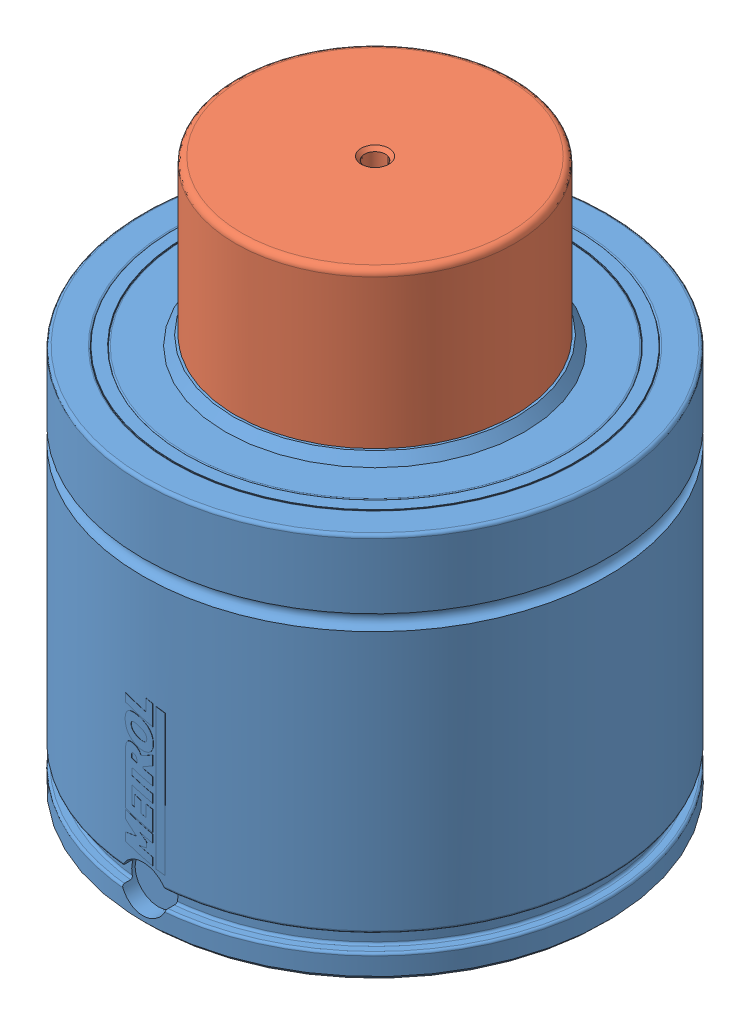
SolidWorks assembly EX9500-050.SLDASM, configuration Default (file format 7000). Lengths in mm.
Overall size (150 178 150.03).
2 component instances, 2 part files, 6 mates.
Components (placement in the parent):
- EX-9500 BODY-1: EX-9500 BODY.SLDPRT [EX-9500-050] x (0 0 1) z (0 -1 0) size (150.03 150 128)
- EX-9500 PISTON-1: EX-9500 PISTON.SLDPRT [EX-9500-050] at (0 95 0) x (-1 0 0) z (0 -1 0) size (110 110 83)
Mates (geometry in assembly coordinates):
- Concentric1: concentric aligned: cylinder of EX-9500 BODY-1 through (0 0 0) axis (0 -1 0) radius 75; cylinder of EX-9500 PISTON-1 through (0 95 0) axis (0 -1 0) radius 45
- LimitDistance1: limit distance anti-aligned: plane of EX-9500 BODY-1 through (-45 105 0) normal (0 -1 0); plane of EX-9500 PISTON-1 through (0 105 -45) normal (0 1 0)
- Coincident2: coincident anti-aligned: plane of EX-9500 BODY-1 through (0 0 0) normal (0 -1 0); plane of assembly through (0 0 0) normal (0 1 0)
- Coincident3: coincident aligned: plane of EX-9500 BODY-1; plane of assembly through (0 0 0) normal (0 0 1)
- Coincident4: coincident anti-aligned: plane of EX-9500 BODY-1; plane of assembly through (0 0 0) normal (1 0 0)
- Coincident5: coincident anti-aligned: plane of EX-9500 PISTON-1; plane of assembly through (0 0 0) normal (0 0 1)
